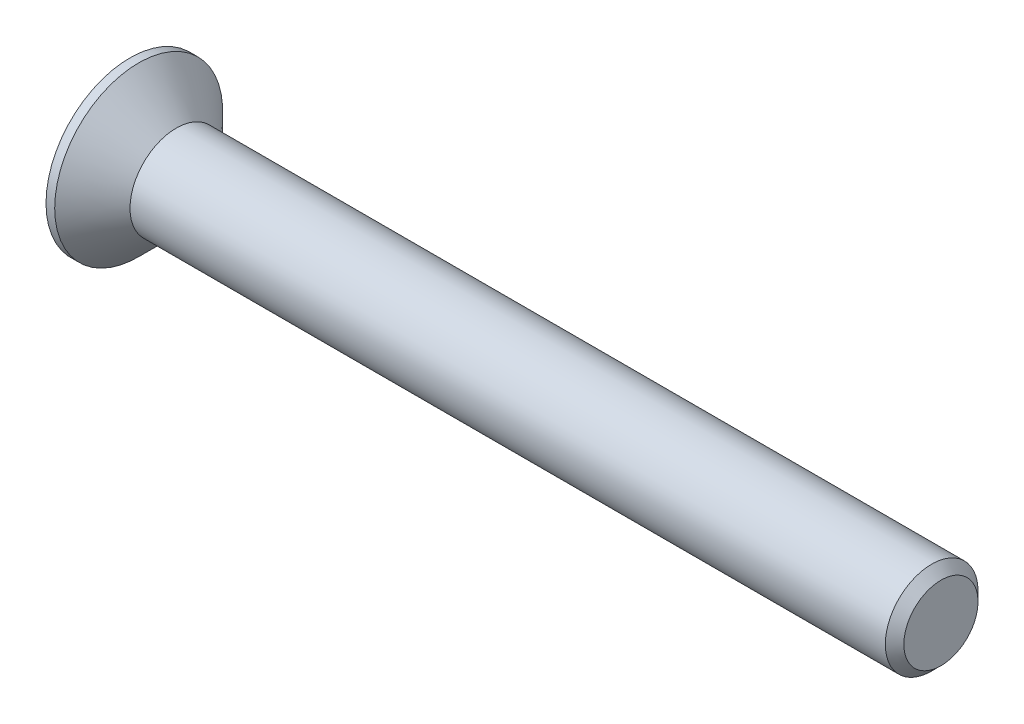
ISO-10303-21;
HEADER;
FILE_DESCRIPTION(('STEP AP214'),'2;1');
FILE_NAME('part.step','',(''),(''),'','','');
FILE_SCHEMA(('AUTOMOTIVE_DESIGN { 1 0 10303 214 1 1 1 1 }'));
ENDSEC;
DATA;
#1=APPLICATION_CONTEXT('core data for automotive mechanical design processes');
#2=APPLICATION_PROTOCOL_DEFINITION('international standard','automotive_design',2000,#1);
#3=PRODUCT_CONTEXT('',#1,'mechanical');
#4=PRODUCT('Part','Part','',(#3));
#5=PRODUCT_RELATED_PRODUCT_CATEGORY('part','',(#4));
#6=PRODUCT_DEFINITION_FORMATION('','',#4);
#7=PRODUCT_DEFINITION_CONTEXT('part definition',#1,'design');
#8=PRODUCT_DEFINITION('design','',#6,#7);
#9=PRODUCT_DEFINITION_SHAPE('','',#8);
#10=(LENGTH_UNIT() NAMED_UNIT(*) SI_UNIT(.MILLI.,.METRE.));
#11=(NAMED_UNIT(*) PLANE_ANGLE_UNIT() SI_UNIT($,.RADIAN.));
#12=(NAMED_UNIT(*) SI_UNIT($,.STERADIAN.) SOLID_ANGLE_UNIT());
#13=UNCERTAINTY_MEASURE_WITH_UNIT(LENGTH_MEASURE(1.E-05),#10,'distance_accuracy_value','');
#14=(GEOMETRIC_REPRESENTATION_CONTEXT(3) GLOBAL_UNCERTAINTY_ASSIGNED_CONTEXT((#13)) GLOBAL_UNIT_ASSIGNED_CONTEXT((#10,
#11,#12)) REPRESENTATION_CONTEXT('',''));
#15=CARTESIAN_POINT('',(0.,0.,0.));
#16=DIRECTION('',(0.,0.,1.));
#17=DIRECTION('',(1.,0.,0.));
#18=AXIS2_PLACEMENT_3D('',#15,#16,#17);
#19=CARTESIAN_POINT('',(0.,0.,0.));
#20=DIRECTION('',(-1.,0.,0.));
#21=DIRECTION('',(0.,0.,1.));
#22=AXIS2_PLACEMENT_3D('',#19,#20,#21);
#23=CONICAL_SURFACE('',#22,4.,0.78539816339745);
#24=CARTESIAN_POINT('',(-3.24999999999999,0.,0.));
#25=DIRECTION('',(-1.,0.,0.));
#26=DIRECTION('',(0.,0.,1.));
#27=AXIS2_PLACEMENT_3D('',#24,#25,#26);
#28=CIRCLE('',#27,7.25);
#29=CARTESIAN_POINT('',(-3.24999999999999,0.,7.25));
#30=VERTEX_POINT('',#29);
#31=EDGE_CURVE('E189',#30,#30,#28,.T.);
#32=ORIENTED_EDGE('',*,*,#31,.F.);
#33=EDGE_LOOP('',(#32));
#34=FACE_BOUND('',#33,.T.);
#35=CARTESIAN_POINT('',(0.,0.,0.));
#36=DIRECTION('',(-1.,0.,0.));
#37=DIRECTION('',(0.,0.,1.));
#38=AXIS2_PLACEMENT_3D('',#35,#36,#37);
#39=CIRCLE('',#38,4.);
#40=CARTESIAN_POINT('',(0.,0.,4.));
#41=VERTEX_POINT('',#40);
#42=EDGE_CURVE('E212',#41,#41,#39,.T.);
#43=ORIENTED_EDGE('',*,*,#42,.T.);
#44=EDGE_LOOP('',(#43));
#45=FACE_BOUND('',#44,.T.);
#46=ADVANCED_FACE('F33',(#34,#45),#23,.T.);
#47=CARTESIAN_POINT('',(-4.,0.,0.));
#48=DIRECTION('',(-1.,0.,0.));
#49=DIRECTION('',(0.,0.,1.));
#50=AXIS2_PLACEMENT_3D('',#47,#48,#49);
#51=CYLINDRICAL_SURFACE('',#50,4.);
#52=CARTESIAN_POINT('',(65.2,0.,0.));
#53=DIRECTION('',(-1.,0.,0.));
#54=DIRECTION('',(0.,0.,1.));
#55=AXIS2_PLACEMENT_3D('',#52,#53,#54);
#56=CIRCLE('',#55,4.);
#57=CARTESIAN_POINT('',(65.2,0.,4.));
#58=VERTEX_POINT('',#57);
#59=EDGE_CURVE('E41',#58,#58,#56,.T.);
#60=ORIENTED_EDGE('',*,*,#59,.T.);
#61=EDGE_LOOP('',(#60));
#62=FACE_BOUND('',#61,.T.);
#63=ORIENTED_EDGE('',*,*,#42,.F.);
#64=EDGE_LOOP('',(#63));
#65=FACE_BOUND('',#64,.T.);
#66=ADVANCED_FACE('F217',(#62,#65),#51,.T.);
#67=CARTESIAN_POINT('',(66.,0.,0.));
#68=DIRECTION('',(-1.,0.,0.));
#69=DIRECTION('',(0.,0.,1.));
#70=AXIS2_PLACEMENT_3D('',#67,#68,#69);
#71=PLANE('',#70);
#72=CARTESIAN_POINT('',(66.,0.,0.));
#73=DIRECTION('',(-1.,0.,0.));
#74=DIRECTION('',(0.,0.,1.));
#75=AXIS2_PLACEMENT_3D('',#72,#73,#74);
#76=CIRCLE('',#75,3.19999999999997);
#77=CARTESIAN_POINT('',(66.,0.,3.19999999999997));
#78=VERTEX_POINT('',#77);
#79=EDGE_CURVE('E11',#78,#78,#76,.F.);
#80=ORIENTED_EDGE('',*,*,#79,.T.);
#81=EDGE_LOOP('',(#80));
#82=FACE_BOUND('',#81,.T.);
#83=ADVANCED_FACE('F239',(#82),#71,.F.);
#84=CARTESIAN_POINT('',(-4.,7.25,0.));
#85=DIRECTION('',(1.,0.,0.));
#86=DIRECTION('',(0.,0.,-1.));
#87=AXIS2_PLACEMENT_3D('',#84,#85,#86);
#88=PLANE('',#87);
#89=DIRECTION('',(0.,0.,-1.));
#90=VECTOR('',#89,1.);
#91=CARTESIAN_POINT('',(-4.,1.09,-4.35));
#92=LINE('',#91,#90);
#93=CARTESIAN_POINT('',(-4.,1.09,-1.09));
#94=VERTEX_POINT('',#93);
#95=CARTESIAN_POINT('',(-4.,1.09,-4.35));
#96=VERTEX_POINT('',#95);
#97=EDGE_CURVE('E158',#94,#96,#92,.T.);
#98=ORIENTED_EDGE('',*,*,#97,.F.);
#99=DIRECTION('',(0.,-1.,0.));
#100=VECTOR('',#99,1.);
#101=CARTESIAN_POINT('',(-4.,1.09,-1.09));
#102=LINE('',#101,#100);
#103=CARTESIAN_POINT('',(-4.,4.35,-1.09));
#104=VERTEX_POINT('',#103);
#105=EDGE_CURVE('E48',#104,#94,#102,.T.);
#106=ORIENTED_EDGE('',*,*,#105,.F.);
#107=DIRECTION('',(0.,0.,-1.));
#108=VECTOR('',#107,1.);
#109=CARTESIAN_POINT('',(-4.,4.35,-1.09));
#110=LINE('',#109,#108);
#111=CARTESIAN_POINT('',(-4.,4.35,1.09));
#112=VERTEX_POINT('',#111);
#113=EDGE_CURVE('E185',#112,#104,#110,.T.);
#114=ORIENTED_EDGE('',*,*,#113,.F.);
#115=DIRECTION('',(0.,1.,0.));
#116=VECTOR('',#115,1.);
#117=CARTESIAN_POINT('',(-4.,4.35,1.09));
#118=LINE('',#117,#116);
#119=CARTESIAN_POINT('',(-4.,1.09,1.09));
#120=VERTEX_POINT('',#119);
#121=EDGE_CURVE('E183',#120,#112,#118,.T.);
#122=ORIENTED_EDGE('',*,*,#121,.F.);
#123=DIRECTION('',(0.,0.,-1.));
#124=VECTOR('',#123,1.);
#125=CARTESIAN_POINT('',(-4.,1.09,1.09));
#126=LINE('',#125,#124);
#127=CARTESIAN_POINT('',(-4.,1.09,4.35));
#128=VERTEX_POINT('',#127);
#129=EDGE_CURVE('E132',#128,#120,#126,.T.);
#130=ORIENTED_EDGE('',*,*,#129,.F.);
#131=DIRECTION('',(0.,1.,0.));
#132=VECTOR('',#131,1.);
#133=CARTESIAN_POINT('',(-4.,1.09,4.35));
#134=LINE('',#133,#132);
#135=CARTESIAN_POINT('',(-4.,-1.09,4.35));
#136=VERTEX_POINT('',#135);
#137=EDGE_CURVE('E179',#136,#128,#134,.T.);
#138=ORIENTED_EDGE('',*,*,#137,.F.);
#139=DIRECTION('',(0.,0.,1.));
#140=VECTOR('',#139,1.);
#141=CARTESIAN_POINT('',(-4.,-1.09,4.35));
#142=LINE('',#141,#140);
#143=CARTESIAN_POINT('',(-4.,-1.09,1.09));
#144=VERTEX_POINT('',#143);
#145=EDGE_CURVE('E176',#144,#136,#142,.T.);
#146=ORIENTED_EDGE('',*,*,#145,.F.);
#147=DIRECTION('',(0.,1.,0.));
#148=VECTOR('',#147,1.);
#149=CARTESIAN_POINT('',(-4.,-1.09,1.09));
#150=LINE('',#149,#148);
#151=CARTESIAN_POINT('',(-4.,-4.35,1.09));
#152=VERTEX_POINT('',#151);
#153=EDGE_CURVE('E173',#152,#144,#150,.T.);
#154=ORIENTED_EDGE('',*,*,#153,.F.);
#155=DIRECTION('',(0.,0.,1.));
#156=VECTOR('',#155,1.);
#157=CARTESIAN_POINT('',(-4.,-4.35,1.09));
#158=LINE('',#157,#156);
#159=CARTESIAN_POINT('',(-4.,-4.35,-1.09));
#160=VERTEX_POINT('',#159);
#161=EDGE_CURVE('E170',#160,#152,#158,.T.);
#162=ORIENTED_EDGE('',*,*,#161,.F.);
#163=DIRECTION('',(0.,-1.,0.));
#164=VECTOR('',#163,1.);
#165=CARTESIAN_POINT('',(-4.,-4.35,-1.09));
#166=LINE('',#165,#164);
#167=CARTESIAN_POINT('',(-4.,-1.09,-1.09));
#168=VERTEX_POINT('',#167);
#169=EDGE_CURVE('E167',#168,#160,#166,.T.);
#170=ORIENTED_EDGE('',*,*,#169,.F.);
#171=DIRECTION('',(0.,0.,1.));
#172=VECTOR('',#171,1.);
#173=CARTESIAN_POINT('',(-4.,-1.09,-1.09));
#174=LINE('',#173,#172);
#175=CARTESIAN_POINT('',(-4.,-1.09,-4.35));
#176=VERTEX_POINT('',#175);
#177=EDGE_CURVE('E164',#176,#168,#174,.T.);
#178=ORIENTED_EDGE('',*,*,#177,.F.);
#179=DIRECTION('',(0.,-1.,0.));
#180=VECTOR('',#179,1.);
#181=CARTESIAN_POINT('',(-4.,-1.09,-4.35));
#182=LINE('',#181,#180);
#183=EDGE_CURVE('E161',#96,#176,#182,.T.);
#184=ORIENTED_EDGE('',*,*,#183,.F.);
#185=EDGE_LOOP('',(#98,#106,#114,#122,#130,#138,#146,#154,#162,#170,#178,#184));
#186=FACE_BOUND('',#185,.T.);
#187=CARTESIAN_POINT('',(-4.,0.,0.));
#188=DIRECTION('',(-1.,0.,0.));
#189=DIRECTION('',(0.,0.,1.));
#190=AXIS2_PLACEMENT_3D('',#187,#188,#189);
#191=CIRCLE('',#190,7.25);
#192=CARTESIAN_POINT('',(-4.,0.,7.25));
#193=VERTEX_POINT('',#192);
#194=EDGE_CURVE('E209',#193,#193,#191,.T.);
#195=ORIENTED_EDGE('',*,*,#194,.T.);
#196=EDGE_LOOP('',(#195));
#197=FACE_BOUND('',#196,.T.);
#198=ADVANCED_FACE('F230',(#186,#197),#88,.F.);
#199=CARTESIAN_POINT('',(-4.,0.,0.));
#200=DIRECTION('',(-1.,0.,0.));
#201=DIRECTION('',(0.,0.,1.));
#202=AXIS2_PLACEMENT_3D('',#199,#200,#201);
#203=CYLINDRICAL_SURFACE('',#202,7.25);
#204=ORIENTED_EDGE('',*,*,#194,.F.);
#205=EDGE_LOOP('',(#204));
#206=FACE_BOUND('',#205,.T.);
#207=ORIENTED_EDGE('',*,*,#31,.T.);
#208=EDGE_LOOP('',(#207));
#209=FACE_BOUND('',#208,.T.);
#210=ADVANCED_FACE('F222',(#206,#209),#203,.T.);
#211=CARTESIAN_POINT('',(65.2,0.,0.));
#212=DIRECTION('',(-1.,0.,0.));
#213=DIRECTION('',(0.,0.,1.));
#214=AXIS2_PLACEMENT_3D('',#211,#212,#213);
#215=CONICAL_SURFACE('',#214,4.,0.785398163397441);
#216=ORIENTED_EDGE('',*,*,#79,.F.);
#217=EDGE_LOOP('',(#216));
#218=FACE_BOUND('',#217,.T.);
#219=ORIENTED_EDGE('',*,*,#59,.F.);
#220=EDGE_LOOP('',(#219));
#221=FACE_BOUND('',#220,.T.);
#222=ADVANCED_FACE('F35',(#218,#221),#215,.T.);
#223=CARTESIAN_POINT('',(-0.55,1.09,-1.09));
#224=DIRECTION('',(0.,0.,-1.));
#225=DIRECTION('',(-1.,0.,0.));
#226=AXIS2_PLACEMENT_3D('',#223,#224,#225);
#227=PLANE('',#226);
#228=ORIENTED_EDGE('',*,*,#105,.T.);
#229=DIRECTION('',(-1.,0.,0.));
#230=VECTOR('',#229,1.);
#231=CARTESIAN_POINT('',(-0.55,1.09,-1.09));
#232=LINE('',#231,#230);
#233=CARTESIAN_POINT('',(-0.55,1.09,-1.09));
#234=VERTEX_POINT('',#233);
#235=EDGE_CURVE('E96',#234,#94,#232,.T.);
#236=ORIENTED_EDGE('',*,*,#235,.F.);
#237=DIRECTION('',(0.,-1.,0.));
#238=VECTOR('',#237,1.);
#239=CARTESIAN_POINT('',(-0.55,1.09,-1.09));
#240=LINE('',#239,#238);
#241=CARTESIAN_POINT('',(-0.55,4.35,-1.09));
#242=VERTEX_POINT('',#241);
#243=EDGE_CURVE('E187',#242,#234,#240,.T.);
#244=ORIENTED_EDGE('',*,*,#243,.F.);
#245=DIRECTION('',(-1.,0.,0.));
#246=VECTOR('',#245,1.);
#247=CARTESIAN_POINT('',(-0.55,4.35,-1.09));
#248=LINE('',#247,#246);
#249=EDGE_CURVE('E56',#242,#104,#248,.T.);
#250=ORIENTED_EDGE('',*,*,#249,.T.);
#251=EDGE_LOOP('',(#228,#236,#244,#250));
#252=FACE_BOUND('',#251,.T.);
#253=ADVANCED_FACE('F221',(#252),#227,.F.);
#254=CARTESIAN_POINT('',(-0.55,4.35,-1.09));
#255=DIRECTION('',(0.,1.,0.));
#256=DIRECTION('',(-1.,0.,0.));
#257=AXIS2_PLACEMENT_3D('',#254,#255,#256);
#258=PLANE('',#257);
#259=ORIENTED_EDGE('',*,*,#113,.T.);
#260=ORIENTED_EDGE('',*,*,#249,.F.);
#261=DIRECTION('',(0.,0.,-1.));
#262=VECTOR('',#261,1.);
#263=CARTESIAN_POINT('',(-0.55,4.35,-1.09));
#264=LINE('',#263,#262);
#265=CARTESIAN_POINT('',(-0.55,4.35,1.09));
#266=VERTEX_POINT('',#265);
#267=EDGE_CURVE('E144',#266,#242,#264,.T.);
#268=ORIENTED_EDGE('',*,*,#267,.F.);
#269=DIRECTION('',(-1.,0.,0.));
#270=VECTOR('',#269,1.);
#271=CARTESIAN_POINT('',(-0.55,4.35,1.09));
#272=LINE('',#271,#270);
#273=EDGE_CURVE('E136',#266,#112,#272,.T.);
#274=ORIENTED_EDGE('',*,*,#273,.T.);
#275=EDGE_LOOP('',(#259,#260,#268,#274));
#276=FACE_BOUND('',#275,.T.);
#277=ADVANCED_FACE('F228',(#276),#258,.F.);
#278=CARTESIAN_POINT('',(-0.55,4.35,1.09));
#279=DIRECTION('',(0.,0.,1.));
#280=DIRECTION('',(1.,0.,0.));
#281=AXIS2_PLACEMENT_3D('',#278,#279,#280);
#282=PLANE('',#281);
#283=ORIENTED_EDGE('',*,*,#121,.T.);
#284=ORIENTED_EDGE('',*,*,#273,.F.);
#285=DIRECTION('',(0.,1.,0.));
#286=VECTOR('',#285,1.);
#287=CARTESIAN_POINT('',(-0.55,4.35,1.09));
#288=LINE('',#287,#286);
#289=CARTESIAN_POINT('',(-0.55,1.09,1.09));
#290=VERTEX_POINT('',#289);
#291=EDGE_CURVE('E140',#290,#266,#288,.T.);
#292=ORIENTED_EDGE('',*,*,#291,.F.);
#293=DIRECTION('',(-1.,0.,0.));
#294=VECTOR('',#293,1.);
#295=CARTESIAN_POINT('',(-0.55,1.09,1.09));
#296=LINE('',#295,#294);
#297=EDGE_CURVE('E125',#290,#120,#296,.T.);
#298=ORIENTED_EDGE('',*,*,#297,.T.);
#299=EDGE_LOOP('',(#283,#284,#292,#298));
#300=FACE_BOUND('',#299,.T.);
#301=ADVANCED_FACE('F141',(#300),#282,.F.);
#302=CARTESIAN_POINT('',(-0.55,1.09,1.09));
#303=DIRECTION('',(0.,1.,0.));
#304=DIRECTION('',(-1.,0.,0.));
#305=AXIS2_PLACEMENT_3D('',#302,#303,#304);
#306=PLANE('',#305);
#307=ORIENTED_EDGE('',*,*,#129,.T.);
#308=ORIENTED_EDGE('',*,*,#297,.F.);
#309=DIRECTION('',(0.,0.,-1.));
#310=VECTOR('',#309,1.);
#311=CARTESIAN_POINT('',(-0.55,1.09,1.09));
#312=LINE('',#311,#310);
#313=CARTESIAN_POINT('',(-0.55,1.09,4.35));
#314=VERTEX_POINT('',#313);
#315=EDGE_CURVE('E129',#314,#290,#312,.T.);
#316=ORIENTED_EDGE('',*,*,#315,.F.);
#317=DIRECTION('',(-1.,0.,0.));
#318=VECTOR('',#317,1.);
#319=CARTESIAN_POINT('',(-0.55,1.09,4.35));
#320=LINE('',#319,#318);
#321=EDGE_CURVE('E137',#314,#128,#320,.T.);
#322=ORIENTED_EDGE('',*,*,#321,.T.);
#323=EDGE_LOOP('',(#307,#308,#316,#322));
#324=FACE_BOUND('',#323,.T.);
#325=ADVANCED_FACE('F127',(#324),#306,.F.);
#326=CARTESIAN_POINT('',(-0.55,1.09,4.35));
#327=DIRECTION('',(0.,0.,1.));
#328=DIRECTION('',(1.,0.,0.));
#329=AXIS2_PLACEMENT_3D('',#326,#327,#328);
#330=PLANE('',#329);
#331=ORIENTED_EDGE('',*,*,#137,.T.);
#332=ORIENTED_EDGE('',*,*,#321,.F.);
#333=DIRECTION('',(0.,1.,0.));
#334=VECTOR('',#333,1.);
#335=CARTESIAN_POINT('',(-0.55,1.09,4.35));
#336=LINE('',#335,#334);
#337=CARTESIAN_POINT('',(-0.55,-1.09,4.35));
#338=VERTEX_POINT('',#337);
#339=EDGE_CURVE('E150',#338,#314,#336,.T.);
#340=ORIENTED_EDGE('',*,*,#339,.F.);
#341=DIRECTION('',(-1.,0.,0.));
#342=VECTOR('',#341,1.);
#343=CARTESIAN_POINT('',(-0.55,-1.09,4.35));
#344=LINE('',#343,#342);
#345=EDGE_CURVE('E192',#338,#136,#344,.T.);
#346=ORIENTED_EDGE('',*,*,#345,.T.);
#347=EDGE_LOOP('',(#331,#332,#340,#346));
#348=FACE_BOUND('',#347,.T.);
#349=ADVANCED_FACE('F277',(#348),#330,.F.);
#350=CARTESIAN_POINT('',(-0.55,-1.09,4.35));
#351=DIRECTION('',(0.,-1.,0.));
#352=DIRECTION('',(1.,0.,0.));
#353=AXIS2_PLACEMENT_3D('',#350,#351,#352);
#354=PLANE('',#353);
#355=ORIENTED_EDGE('',*,*,#145,.T.);
#356=ORIENTED_EDGE('',*,*,#345,.F.);
#357=DIRECTION('',(0.,0.,1.));
#358=VECTOR('',#357,1.);
#359=CARTESIAN_POINT('',(-0.55,-1.09,4.35));
#360=LINE('',#359,#358);
#361=CARTESIAN_POINT('',(-0.55,-1.09,1.09));
#362=VERTEX_POINT('',#361);
#363=EDGE_CURVE('E152',#362,#338,#360,.T.);
#364=ORIENTED_EDGE('',*,*,#363,.F.);
#365=DIRECTION('',(-1.,0.,0.));
#366=VECTOR('',#365,1.);
#367=CARTESIAN_POINT('',(-0.55,-1.09,1.09));
#368=LINE('',#367,#366);
#369=EDGE_CURVE('E194',#362,#144,#368,.T.);
#370=ORIENTED_EDGE('',*,*,#369,.T.);
#371=EDGE_LOOP('',(#355,#356,#364,#370));
#372=FACE_BOUND('',#371,.T.);
#373=ADVANCED_FACE('F273',(#372),#354,.F.);
#374=CARTESIAN_POINT('',(-0.55,-1.09,1.09));
#375=DIRECTION('',(0.,0.,1.));
#376=DIRECTION('',(1.,0.,0.));
#377=AXIS2_PLACEMENT_3D('',#374,#375,#376);
#378=PLANE('',#377);
#379=ORIENTED_EDGE('',*,*,#153,.T.);
#380=ORIENTED_EDGE('',*,*,#369,.F.);
#381=DIRECTION('',(0.,1.,0.));
#382=VECTOR('',#381,1.);
#383=CARTESIAN_POINT('',(-0.55,-1.09,1.09));
#384=LINE('',#383,#382);
#385=CARTESIAN_POINT('',(-0.55,-4.35,1.09));
#386=VERTEX_POINT('',#385);
#387=EDGE_CURVE('E422',#386,#362,#384,.T.);
#388=ORIENTED_EDGE('',*,*,#387,.F.);
#389=DIRECTION('',(-1.,0.,0.));
#390=VECTOR('',#389,1.);
#391=CARTESIAN_POINT('',(-0.55,-4.35,1.09));
#392=LINE('',#391,#390);
#393=EDGE_CURVE('E196',#386,#152,#392,.T.);
#394=ORIENTED_EDGE('',*,*,#393,.T.);
#395=EDGE_LOOP('',(#379,#380,#388,#394));
#396=FACE_BOUND('',#395,.T.);
#397=ADVANCED_FACE('F269',(#396),#378,.F.);
#398=CARTESIAN_POINT('',(-0.55,-4.35,1.09));
#399=DIRECTION('',(0.,-1.,0.));
#400=DIRECTION('',(1.,0.,0.));
#401=AXIS2_PLACEMENT_3D('',#398,#399,#400);
#402=PLANE('',#401);
#403=ORIENTED_EDGE('',*,*,#161,.T.);
#404=ORIENTED_EDGE('',*,*,#393,.F.);
#405=DIRECTION('',(0.,0.,1.));
#406=VECTOR('',#405,1.);
#407=CARTESIAN_POINT('',(-0.55,-4.35,1.09));
#408=LINE('',#407,#406);
#409=CARTESIAN_POINT('',(-0.55,-4.35,-1.09));
#410=VERTEX_POINT('',#409);
#411=EDGE_CURVE('E419',#410,#386,#408,.T.);
#412=ORIENTED_EDGE('',*,*,#411,.F.);
#413=DIRECTION('',(-1.,0.,0.));
#414=VECTOR('',#413,1.);
#415=CARTESIAN_POINT('',(-0.55,-4.35,-1.09));
#416=LINE('',#415,#414);
#417=EDGE_CURVE('E198',#410,#160,#416,.T.);
#418=ORIENTED_EDGE('',*,*,#417,.T.);
#419=EDGE_LOOP('',(#403,#404,#412,#418));
#420=FACE_BOUND('',#419,.T.);
#421=ADVANCED_FACE('F265',(#420),#402,.F.);
#422=CARTESIAN_POINT('',(-0.55,-4.35,-1.09));
#423=DIRECTION('',(0.,0.,-1.));
#424=DIRECTION('',(-1.,0.,0.));
#425=AXIS2_PLACEMENT_3D('',#422,#423,#424);
#426=PLANE('',#425);
#427=ORIENTED_EDGE('',*,*,#169,.T.);
#428=ORIENTED_EDGE('',*,*,#417,.F.);
#429=DIRECTION('',(0.,-1.,0.));
#430=VECTOR('',#429,1.);
#431=CARTESIAN_POINT('',(-0.55,-4.35,-1.09));
#432=LINE('',#431,#430);
#433=CARTESIAN_POINT('',(-0.55,-1.09,-1.09));
#434=VERTEX_POINT('',#433);
#435=EDGE_CURVE('E416',#434,#410,#432,.T.);
#436=ORIENTED_EDGE('',*,*,#435,.F.);
#437=DIRECTION('',(-1.,0.,0.));
#438=VECTOR('',#437,1.);
#439=CARTESIAN_POINT('',(-0.55,-1.09,-1.09));
#440=LINE('',#439,#438);
#441=EDGE_CURVE('E200',#434,#168,#440,.T.);
#442=ORIENTED_EDGE('',*,*,#441,.T.);
#443=EDGE_LOOP('',(#427,#428,#436,#442));
#444=FACE_BOUND('',#443,.T.);
#445=ADVANCED_FACE('F261',(#444),#426,.F.);
#446=CARTESIAN_POINT('',(-0.55,-1.09,-1.09));
#447=DIRECTION('',(0.,-1.,0.));
#448=DIRECTION('',(1.,0.,0.));
#449=AXIS2_PLACEMENT_3D('',#446,#447,#448);
#450=PLANE('',#449);
#451=ORIENTED_EDGE('',*,*,#177,.T.);
#452=ORIENTED_EDGE('',*,*,#441,.F.);
#453=DIRECTION('',(0.,0.,1.));
#454=VECTOR('',#453,1.);
#455=CARTESIAN_POINT('',(-0.55,-1.09,-1.09));
#456=LINE('',#455,#454);
#457=CARTESIAN_POINT('',(-0.55,-1.09,-4.35));
#458=VERTEX_POINT('',#457);
#459=EDGE_CURVE('E413',#458,#434,#456,.T.);
#460=ORIENTED_EDGE('',*,*,#459,.F.);
#461=DIRECTION('',(-1.,0.,0.));
#462=VECTOR('',#461,1.);
#463=CARTESIAN_POINT('',(-0.55,-1.09,-4.35));
#464=LINE('',#463,#462);
#465=EDGE_CURVE('E202',#458,#176,#464,.T.);
#466=ORIENTED_EDGE('',*,*,#465,.T.);
#467=EDGE_LOOP('',(#451,#452,#460,#466));
#468=FACE_BOUND('',#467,.T.);
#469=ADVANCED_FACE('F257',(#468),#450,.F.);
#470=CARTESIAN_POINT('',(-0.55,-1.09,-4.35));
#471=DIRECTION('',(0.,0.,-1.));
#472=DIRECTION('',(-1.,0.,0.));
#473=AXIS2_PLACEMENT_3D('',#470,#471,#472);
#474=PLANE('',#473);
#475=ORIENTED_EDGE('',*,*,#183,.T.);
#476=ORIENTED_EDGE('',*,*,#465,.F.);
#477=DIRECTION('',(0.,-1.,0.));
#478=VECTOR('',#477,1.);
#479=CARTESIAN_POINT('',(-0.55,-1.09,-4.35));
#480=LINE('',#479,#478);
#481=CARTESIAN_POINT('',(-0.55,1.09,-4.35));
#482=VERTEX_POINT('',#481);
#483=EDGE_CURVE('E408',#482,#458,#480,.T.);
#484=ORIENTED_EDGE('',*,*,#483,.F.);
#485=DIRECTION('',(-1.,0.,0.));
#486=VECTOR('',#485,1.);
#487=CARTESIAN_POINT('',(-0.55,1.09,-4.35));
#488=LINE('',#487,#486);
#489=EDGE_CURVE('E204',#482,#96,#488,.T.);
#490=ORIENTED_EDGE('',*,*,#489,.T.);
#491=EDGE_LOOP('',(#475,#476,#484,#490));
#492=FACE_BOUND('',#491,.T.);
#493=ADVANCED_FACE('F253',(#492),#474,.F.);
#494=CARTESIAN_POINT('',(-0.55,1.09,-4.35));
#495=DIRECTION('',(0.,1.,0.));
#496=DIRECTION('',(-1.,0.,0.));
#497=AXIS2_PLACEMENT_3D('',#494,#495,#496);
#498=PLANE('',#497);
#499=ORIENTED_EDGE('',*,*,#97,.T.);
#500=ORIENTED_EDGE('',*,*,#489,.F.);
#501=DIRECTION('',(0.,0.,-1.));
#502=VECTOR('',#501,1.);
#503=CARTESIAN_POINT('',(-0.55,1.09,-4.35));
#504=LINE('',#503,#502);
#505=EDGE_CURVE('E406',#234,#482,#504,.T.);
#506=ORIENTED_EDGE('',*,*,#505,.F.);
#507=ORIENTED_EDGE('',*,*,#235,.T.);
#508=EDGE_LOOP('',(#499,#500,#506,#507));
#509=FACE_BOUND('',#508,.T.);
#510=ADVANCED_FACE('F250',(#509),#498,.F.);
#511=CARTESIAN_POINT('',(-0.55,0.,0.));
#512=DIRECTION('',(1.,0.,0.));
#513=DIRECTION('',(0.,0.,-1.));
#514=AXIS2_PLACEMENT_3D('',#511,#512,#513);
#515=PLANE('',#514);
#516=ORIENTED_EDGE('',*,*,#243,.T.);
#517=ORIENTED_EDGE('',*,*,#505,.T.);
#518=ORIENTED_EDGE('',*,*,#483,.T.);
#519=ORIENTED_EDGE('',*,*,#459,.T.);
#520=ORIENTED_EDGE('',*,*,#435,.T.);
#521=ORIENTED_EDGE('',*,*,#411,.T.);
#522=ORIENTED_EDGE('',*,*,#387,.T.);
#523=ORIENTED_EDGE('',*,*,#363,.T.);
#524=ORIENTED_EDGE('',*,*,#339,.T.);
#525=ORIENTED_EDGE('',*,*,#315,.T.);
#526=ORIENTED_EDGE('',*,*,#291,.T.);
#527=ORIENTED_EDGE('',*,*,#267,.T.);
#528=EDGE_LOOP('',(#516,#517,#518,#519,#520,#521,#522,#523,#524,#525,#526,#527));
#529=FACE_BOUND('',#528,.T.);
#530=ADVANCED_FACE('F147',(#529),#515,.F.);
#531=CLOSED_SHELL('',(#46,#66,#83,#198,#210,#222,#253,#277,#301,#325,#349,#373,#397,#421,#445,
#469,#493,#510,#530));
#532=MANIFOLD_SOLID_BREP('B2',#531);
#533=ADVANCED_BREP_SHAPE_REPRESENTATION('',(#18,#532),#14);
#534=SHAPE_DEFINITION_REPRESENTATION(#9,#533);
ENDSEC;
END-ISO-10303-21;
